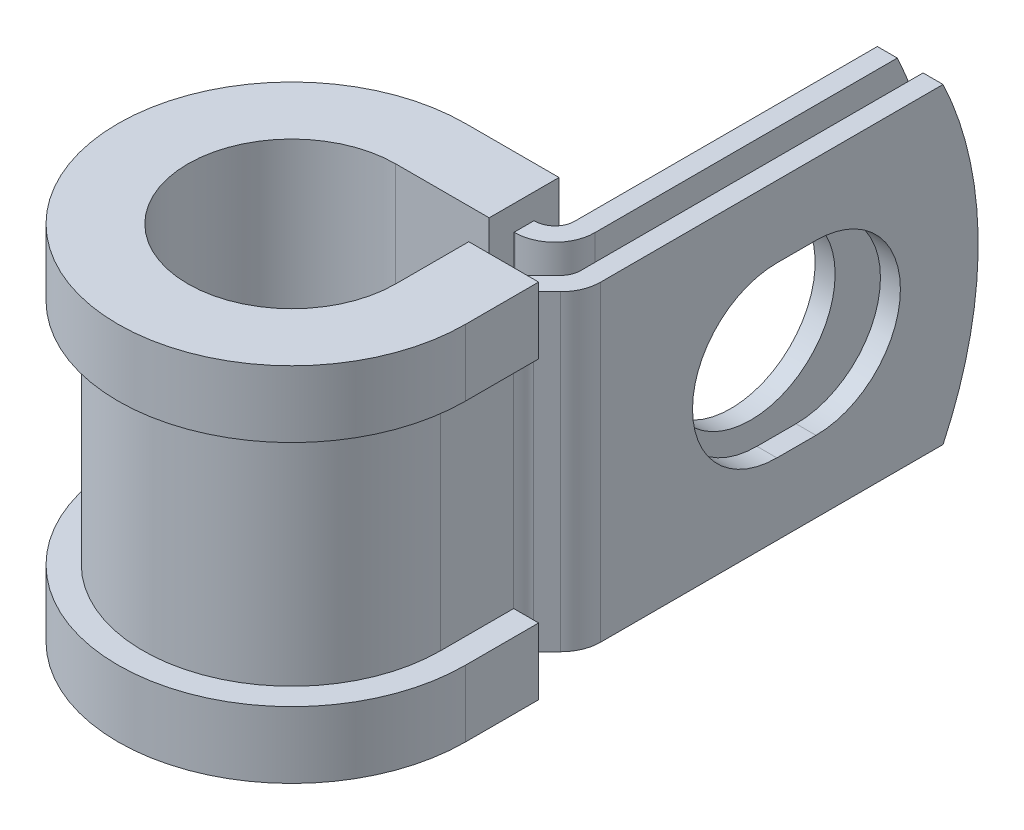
ISO-10303-21;
HEADER;
FILE_DESCRIPTION(('STEP AP214'),'2;1');
FILE_NAME('part.step','',(''),(''),'','','');
FILE_SCHEMA(('AUTOMOTIVE_DESIGN { 1 0 10303 214 1 1 1 1 }'));
ENDSEC;
DATA;
#1=APPLICATION_CONTEXT('core data for automotive mechanical design processes');
#2=APPLICATION_PROTOCOL_DEFINITION('international standard','automotive_design',2000,#1);
#3=PRODUCT_CONTEXT('',#1,'mechanical');
#4=PRODUCT('Part','Part','',(#3));
#5=PRODUCT_RELATED_PRODUCT_CATEGORY('part','',(#4));
#6=PRODUCT_DEFINITION_FORMATION('','',#4);
#7=PRODUCT_DEFINITION_CONTEXT('part definition',#1,'design');
#8=PRODUCT_DEFINITION('design','',#6,#7);
#9=PRODUCT_DEFINITION_SHAPE('','',#8);
#10=(LENGTH_UNIT() NAMED_UNIT(*) SI_UNIT(.MILLI.,.METRE.));
#11=(NAMED_UNIT(*) PLANE_ANGLE_UNIT() SI_UNIT($,.RADIAN.));
#12=(NAMED_UNIT(*) SI_UNIT($,.STERADIAN.) SOLID_ANGLE_UNIT());
#13=UNCERTAINTY_MEASURE_WITH_UNIT(LENGTH_MEASURE(1.E-05),#10,'distance_accuracy_value','');
#14=(GEOMETRIC_REPRESENTATION_CONTEXT(3) GLOBAL_UNCERTAINTY_ASSIGNED_CONTEXT((#13)) GLOBAL_UNIT_ASSIGNED_CONTEXT((#10,
#11,#12)) REPRESENTATION_CONTEXT('',''));
#15=CARTESIAN_POINT('',(0.,0.,0.));
#16=DIRECTION('',(0.,0.,1.));
#17=DIRECTION('',(1.,0.,0.));
#18=AXIS2_PLACEMENT_3D('',#15,#16,#17);
#19=CARTESIAN_POINT('',(8.55226980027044,-9.525,-7.874));
#20=DIRECTION('',(0.,1.,0.));
#21=DIRECTION('',(1.,0.,0.));
#22=AXIS2_PLACEMENT_3D('',#19,#20,#21);
#23=PLANE('',#22);
#24=DIRECTION('',(0.,0.,-1.));
#25=VECTOR('',#24,1.);
#26=CARTESIAN_POINT('',(5.70746980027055,-9.525,-7.874));
#27=LINE('',#26,#25);
#28=CARTESIAN_POINT('',(5.70746980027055,-9.525,-7.874));
#29=VERTEX_POINT('',#28);
#30=CARTESIAN_POINT('',(5.70746980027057,-9.525,-9.0932));
#31=VERTEX_POINT('',#30);
#32=EDGE_CURVE('E523',#29,#31,#27,.T.);
#33=ORIENTED_EDGE('',*,*,#32,.T.);
#34=DIRECTION('',(1.,0.,0.));
#35=VECTOR('',#34,1.);
#36=CARTESIAN_POINT('',(0.,-9.525,-9.0932));
#37=LINE('',#36,#35);
#38=CARTESIAN_POINT('',(5.75826980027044,-9.525,-9.0932));
#39=VERTEX_POINT('',#38);
#40=EDGE_CURVE('E410',#39,#31,#37,.F.);
#41=ORIENTED_EDGE('',*,*,#40,.F.);
#42=CARTESIAN_POINT('',(5.75826980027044,-9.525,-10.3124));
#43=DIRECTION('',(0.,1.,0.));
#44=DIRECTION('',(1.,0.,0.));
#45=AXIS2_PLACEMENT_3D('',#42,#43,#44);
#46=CIRCLE('',#45,1.2192);
#47=CARTESIAN_POINT('',(6.97746980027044,-9.525,-10.3124));
#48=VERTEX_POINT('',#47);
#49=EDGE_CURVE('E408',#48,#39,#46,.F.);
#50=ORIENTED_EDGE('',*,*,#49,.F.);
#51=DIRECTION('',(0.,0.,-1.));
#52=VECTOR('',#51,1.);
#53=CARTESIAN_POINT('',(6.97746980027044,-9.525,-30.9372));
#54=LINE('',#53,#52);
#55=CARTESIAN_POINT('',(6.97746980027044,-9.525,-28.7926631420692));
#56=VERTEX_POINT('',#55);
#57=EDGE_CURVE('E406',#56,#48,#54,.F.);
#58=ORIENTED_EDGE('',*,*,#57,.F.);
#59=DIRECTION('',(-1.,0.,0.));
#60=VECTOR('',#59,1.);
#61=CARTESIAN_POINT('',(10.9906698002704,-9.525,-28.7926631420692));
#62=LINE('',#61,#60);
#63=CARTESIAN_POINT('',(8.19666980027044,-9.525,-28.7926631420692));
#64=VERTEX_POINT('',#63);
#65=EDGE_CURVE('E12',#64,#56,#62,.T.);
#66=ORIENTED_EDGE('',*,*,#65,.F.);
#67=DIRECTION('',(0.,0.,1.));
#68=VECTOR('',#67,1.);
#69=CARTESIAN_POINT('',(8.19666980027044,-9.525,-30.9372));
#70=LINE('',#69,#68);
#71=CARTESIAN_POINT('',(8.19666980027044,-9.525,-10.3124));
#72=VERTEX_POINT('',#71);
#73=EDGE_CURVE('E404',#64,#72,#70,.T.);
#74=ORIENTED_EDGE('',*,*,#73,.T.);
#75=CARTESIAN_POINT('',(5.75826980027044,-9.525,-10.3124));
#76=DIRECTION('',(0.,-1.,0.));
#77=DIRECTION('',(0.,0.,1.));
#78=AXIS2_PLACEMENT_3D('',#75,#76,#77);
#79=CIRCLE('',#78,2.4384);
#80=CARTESIAN_POINT('',(5.75826980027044,-9.525,-7.874));
#81=VERTEX_POINT('',#80);
#82=EDGE_CURVE('E401',#72,#81,#79,.T.);
#83=ORIENTED_EDGE('',*,*,#82,.T.);
#84=DIRECTION('',(-1.,0.,0.));
#85=VECTOR('',#84,1.);
#86=CARTESIAN_POINT('',(0.,-9.525,-7.874));
#87=LINE('',#86,#85);
#88=EDGE_CURVE('E398',#81,#29,#87,.T.);
#89=ORIENTED_EDGE('',*,*,#88,.T.);
#90=EDGE_LOOP('',(#33,#41,#50,#58,#66,#74,#83,#89));
#91=FACE_BOUND('',#90,.T.);
#92=ADVANCED_FACE('F54',(#91),#23,.F.);
#93=CARTESIAN_POINT('',(8.55226980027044,9.525,-7.874));
#94=DIRECTION('',(0.,1.,0.));
#95=DIRECTION('',(1.,0.,0.));
#96=AXIS2_PLACEMENT_3D('',#93,#94,#95);
#97=PLANE('',#96);
#98=DIRECTION('',(1.,0.,0.));
#99=VECTOR('',#98,1.);
#100=CARTESIAN_POINT('',(0.,9.525,-9.0932));
#101=LINE('',#100,#99);
#102=CARTESIAN_POINT('',(5.75826980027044,9.525,-9.0932));
#103=VERTEX_POINT('',#102);
#104=CARTESIAN_POINT('',(5.70746980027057,9.525,-9.0932));
#105=VERTEX_POINT('',#104);
#106=EDGE_CURVE('E368',#103,#105,#101,.F.);
#107=ORIENTED_EDGE('',*,*,#106,.T.);
#108=DIRECTION('',(0.,0.,1.));
#109=VECTOR('',#108,1.);
#110=CARTESIAN_POINT('',(5.70746980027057,9.525,-9.0932));
#111=LINE('',#110,#109);
#112=CARTESIAN_POINT('',(5.70746980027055,9.525,-7.874));
#113=VERTEX_POINT('',#112);
#114=EDGE_CURVE('E517',#105,#113,#111,.T.);
#115=ORIENTED_EDGE('',*,*,#114,.T.);
#116=DIRECTION('',(-1.,0.,0.));
#117=VECTOR('',#116,1.);
#118=CARTESIAN_POINT('',(0.,9.525,-7.874));
#119=LINE('',#118,#117);
#120=CARTESIAN_POINT('',(5.75826980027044,9.525,-7.874));
#121=VERTEX_POINT('',#120);
#122=EDGE_CURVE('E625',#121,#113,#119,.T.);
#123=ORIENTED_EDGE('',*,*,#122,.F.);
#124=CARTESIAN_POINT('',(5.75826980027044,9.525,-10.3124));
#125=DIRECTION('',(0.,-1.,0.));
#126=DIRECTION('',(0.,0.,1.));
#127=AXIS2_PLACEMENT_3D('',#124,#125,#126);
#128=CIRCLE('',#127,2.4384);
#129=CARTESIAN_POINT('',(8.19666980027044,9.525,-10.3124));
#130=VERTEX_POINT('',#129);
#131=EDGE_CURVE('E370',#130,#121,#128,.T.);
#132=ORIENTED_EDGE('',*,*,#131,.F.);
#133=DIRECTION('',(0.,0.,1.));
#134=VECTOR('',#133,1.);
#135=CARTESIAN_POINT('',(8.19666980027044,9.525,-30.9372));
#136=LINE('',#135,#134);
#137=CARTESIAN_POINT('',(8.19666980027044,9.525,-28.7926631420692));
#138=VERTEX_POINT('',#137);
#139=EDGE_CURVE('E361',#138,#130,#136,.T.);
#140=ORIENTED_EDGE('',*,*,#139,.F.);
#141=DIRECTION('',(-1.,0.,0.));
#142=VECTOR('',#141,1.);
#143=CARTESIAN_POINT('',(10.9906698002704,9.525,-28.7926631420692));
#144=LINE('',#143,#142);
#145=CARTESIAN_POINT('',(6.97746980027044,9.525,-28.7926631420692));
#146=VERTEX_POINT('',#145);
#147=EDGE_CURVE('E62',#138,#146,#144,.T.);
#148=ORIENTED_EDGE('',*,*,#147,.T.);
#149=DIRECTION('',(0.,0.,-1.));
#150=VECTOR('',#149,1.);
#151=CARTESIAN_POINT('',(6.97746980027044,9.525,-30.9372));
#152=LINE('',#151,#150);
#153=CARTESIAN_POINT('',(6.97746980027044,9.525,-10.3124));
#154=VERTEX_POINT('',#153);
#155=EDGE_CURVE('E358',#146,#154,#152,.F.);
#156=ORIENTED_EDGE('',*,*,#155,.T.);
#157=CARTESIAN_POINT('',(5.75826980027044,9.525,-10.3124));
#158=DIRECTION('',(0.,1.,0.));
#159=DIRECTION('',(1.,0.,0.));
#160=AXIS2_PLACEMENT_3D('',#157,#158,#159);
#161=CIRCLE('',#160,1.2192);
#162=EDGE_CURVE('E366',#154,#103,#161,.F.);
#163=ORIENTED_EDGE('',*,*,#162,.T.);
#164=EDGE_LOOP('',(#107,#115,#123,#132,#140,#148,#156,#163));
#165=FACE_BOUND('',#164,.T.);
#166=ADVANCED_FACE('F357',(#165),#97,.T.);
#167=CARTESIAN_POINT('',(0.,9.525,-7.874));
#168=DIRECTION('',(0.,0.,1.));
#169=DIRECTION('',(1.,0.,0.));
#170=AXIS2_PLACEMENT_3D('',#167,#168,#169);
#171=PLANE('',#170);
#172=ORIENTED_EDGE('',*,*,#122,.T.);
#173=DIRECTION('',(0.,-1.,0.));
#174=VECTOR('',#173,1.);
#175=CARTESIAN_POINT('',(5.70746980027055,9.525,-7.874));
#176=LINE('',#175,#174);
#177=EDGE_CURVE('E520',#113,#29,#176,.T.);
#178=ORIENTED_EDGE('',*,*,#177,.T.);
#179=ORIENTED_EDGE('',*,*,#88,.F.);
#180=DIRECTION('',(0.,-1.,0.));
#181=VECTOR('',#180,1.);
#182=CARTESIAN_POINT('',(5.75826980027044,9.525,-7.874));
#183=LINE('',#182,#181);
#184=EDGE_CURVE('E344',#121,#81,#183,.T.);
#185=ORIENTED_EDGE('',*,*,#184,.F.);
#186=EDGE_LOOP('',(#172,#178,#179,#185));
#187=FACE_BOUND('',#186,.T.);
#188=ADVANCED_FACE('F635',(#187),#171,.T.);
#189=CARTESIAN_POINT('',(10.9906698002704,9.525,-7.874));
#190=DIRECTION('',(-1.,0.,0.));
#191=DIRECTION('',(0.,0.,1.));
#192=AXIS2_PLACEMENT_3D('',#189,#190,#191);
#193=PLANE('',#192);
#194=CARTESIAN_POINT('',(10.9906698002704,0.,-21.0311999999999));
#195=DIRECTION('',(1.,0.,0.));
#196=DIRECTION('',(0.,0.,-1.));
#197=AXIS2_PLACEMENT_3D('',#194,#195,#196);
#198=CIRCLE('',#197,5.1562);
#199=CARTESIAN_POINT('',(10.9906698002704,-5.1562,-21.0312000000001));
#200=VERTEX_POINT('',#199);
#201=CARTESIAN_POINT('',(10.9906698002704,5.1562,-21.0312000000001));
#202=VERTEX_POINT('',#201);
#203=EDGE_CURVE('E580',#200,#202,#198,.T.);
#204=ORIENTED_EDGE('',*,*,#203,.F.);
#205=DIRECTION('',(0.,0.,-1.));
#206=VECTOR('',#205,1.);
#207=CARTESIAN_POINT('',(10.9906698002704,-5.1562,-18.6435999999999));
#208=LINE('',#207,#206);
#209=CARTESIAN_POINT('',(10.9906698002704,-5.1562,-18.6435999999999));
#210=VERTEX_POINT('',#209);
#211=EDGE_CURVE('E583',#210,#200,#208,.T.);
#212=ORIENTED_EDGE('',*,*,#211,.F.);
#213=CARTESIAN_POINT('',(10.9906698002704,0.,-18.6435999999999));
#214=DIRECTION('',(1.,0.,0.));
#215=DIRECTION('',(0.,0.,-1.));
#216=AXIS2_PLACEMENT_3D('',#213,#214,#215);
#217=CIRCLE('',#216,5.1562);
#218=CARTESIAN_POINT('',(10.9906698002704,5.1562,-18.6435999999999));
#219=VERTEX_POINT('',#218);
#220=EDGE_CURVE('E576',#219,#210,#217,.T.);
#221=ORIENTED_EDGE('',*,*,#220,.F.);
#222=DIRECTION('',(0.,0.,1.));
#223=VECTOR('',#222,1.);
#224=CARTESIAN_POINT('',(10.9906698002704,5.1562,-18.6435999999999));
#225=LINE('',#224,#223);
#226=EDGE_CURVE('E577',#202,#219,#225,.T.);
#227=ORIENTED_EDGE('',*,*,#226,.F.);
#228=EDGE_LOOP('',(#204,#212,#221,#227));
#229=FACE_BOUND('',#228,.T.);
#230=DIRECTION('',(0.,0.,-1.));
#231=VECTOR('',#230,1.);
#232=CARTESIAN_POINT('',(10.9906698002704,-9.525,-7.874));
#233=LINE('',#232,#231);
#234=CARTESIAN_POINT('',(10.9906698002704,-9.525,-7.874));
#235=VERTEX_POINT('',#234);
#236=CARTESIAN_POINT('',(10.9906698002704,-9.525,-28.7926631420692));
#237=VERTEX_POINT('',#236);
#238=EDGE_CURVE('E382',#235,#237,#233,.T.);
#239=ORIENTED_EDGE('',*,*,#238,.T.);
#240=CARTESIAN_POINT('',(10.9906698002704,0.,-8.7122));
#241=DIRECTION('',(-1.,0.,0.));
#242=DIRECTION('',(0.,0.,1.));
#243=AXIS2_PLACEMENT_3D('',#240,#241,#242);
#244=CIRCLE('',#243,22.225);
#245=CARTESIAN_POINT('',(10.9906698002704,9.525,-28.7926631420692));
#246=VERTEX_POINT('',#245);
#247=EDGE_CURVE('E568',#246,#237,#244,.T.);
#248=ORIENTED_EDGE('',*,*,#247,.F.);
#249=DIRECTION('',(0.,0.,-1.));
#250=VECTOR('',#249,1.);
#251=CARTESIAN_POINT('',(10.9906698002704,9.525,-7.874));
#252=LINE('',#251,#250);
#253=CARTESIAN_POINT('',(10.9906698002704,9.525,-7.874));
#254=VERTEX_POINT('',#253);
#255=EDGE_CURVE('E419',#254,#246,#252,.T.);
#256=ORIENTED_EDGE('',*,*,#255,.F.);
#257=DIRECTION('',(0.,-1.,0.));
#258=VECTOR('',#257,1.);
#259=CARTESIAN_POINT('',(10.9906698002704,9.525,-7.874));
#260=LINE('',#259,#258);
#261=EDGE_CURVE('E381',#254,#235,#260,.T.);
#262=ORIENTED_EDGE('',*,*,#261,.T.);
#263=EDGE_LOOP('',(#239,#248,#256,#262));
#264=FACE_BOUND('',#263,.T.);
#265=ADVANCED_FACE('F56',(#229,#264),#193,.F.);
#266=CARTESIAN_POINT('',(9.77146980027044,9.525,-7.874));
#267=DIRECTION('',(-1.,0.,0.));
#268=DIRECTION('',(0.,0.,1.));
#269=AXIS2_PLACEMENT_3D('',#266,#267,#268);
#270=PLANE('',#269);
#271=DIRECTION('',(0.,0.,-1.));
#272=VECTOR('',#271,1.);
#273=CARTESIAN_POINT('',(9.77146980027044,-5.1562,-18.6435999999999));
#274=LINE('',#273,#272);
#275=CARTESIAN_POINT('',(9.77146980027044,-5.1562,-18.6435999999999));
#276=VERTEX_POINT('',#275);
#277=CARTESIAN_POINT('',(9.77146980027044,-5.1562,-21.0312000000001));
#278=VERTEX_POINT('',#277);
#279=EDGE_CURVE('E579',#276,#278,#274,.T.);
#280=ORIENTED_EDGE('',*,*,#279,.T.);
#281=CARTESIAN_POINT('',(9.77146980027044,0.,-21.0311999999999));
#282=DIRECTION('',(-1.,0.,0.));
#283=DIRECTION('',(0.,0.,1.));
#284=AXIS2_PLACEMENT_3D('',#281,#282,#283);
#285=CIRCLE('',#284,5.1562);
#286=CARTESIAN_POINT('',(9.77146980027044,5.1562,-21.0312000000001));
#287=VERTEX_POINT('',#286);
#288=EDGE_CURVE('E600',#278,#287,#285,.F.);
#289=ORIENTED_EDGE('',*,*,#288,.T.);
#290=DIRECTION('',(0.,0.,1.));
#291=VECTOR('',#290,1.);
#292=CARTESIAN_POINT('',(9.77146980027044,5.1562,-18.6435999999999));
#293=LINE('',#292,#291);
#294=CARTESIAN_POINT('',(9.77146980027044,5.1562,-18.6435999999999));
#295=VERTEX_POINT('',#294);
#296=EDGE_CURVE('E596',#287,#295,#293,.T.);
#297=ORIENTED_EDGE('',*,*,#296,.T.);
#298=CARTESIAN_POINT('',(9.77146980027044,0.,-18.6435999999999));
#299=DIRECTION('',(-1.,0.,0.));
#300=DIRECTION('',(0.,0.,1.));
#301=AXIS2_PLACEMENT_3D('',#298,#299,#300);
#302=CIRCLE('',#301,5.1562);
#303=EDGE_CURVE('E591',#295,#276,#302,.F.);
#304=ORIENTED_EDGE('',*,*,#303,.T.);
#305=EDGE_LOOP('',(#280,#289,#297,#304));
#306=FACE_BOUND('',#305,.T.);
#307=CARTESIAN_POINT('',(9.77146980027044,0.,-8.7122));
#308=DIRECTION('',(-1.,0.,0.));
#309=DIRECTION('',(0.,0.,1.));
#310=AXIS2_PLACEMENT_3D('',#307,#308,#309);
#311=CIRCLE('',#310,22.225);
#312=CARTESIAN_POINT('',(9.77146980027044,9.525,-28.7926631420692));
#313=VERTEX_POINT('',#312);
#314=CARTESIAN_POINT('',(9.77146980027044,-9.525,-28.7926631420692));
#315=VERTEX_POINT('',#314);
#316=EDGE_CURVE('E76',#313,#315,#311,.T.);
#317=ORIENTED_EDGE('',*,*,#316,.T.);
#318=DIRECTION('',(0.,0.,-1.));
#319=VECTOR('',#318,1.);
#320=CARTESIAN_POINT('',(9.77146980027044,-9.525,-7.874));
#321=LINE('',#320,#319);
#322=CARTESIAN_POINT('',(9.77146980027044,-9.525,-7.874));
#323=VERTEX_POINT('',#322);
#324=EDGE_CURVE('E385',#323,#315,#321,.T.);
#325=ORIENTED_EDGE('',*,*,#324,.F.);
#326=DIRECTION('',(0.,-1.,0.));
#327=VECTOR('',#326,1.);
#328=CARTESIAN_POINT('',(9.77146980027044,9.525,-7.874));
#329=LINE('',#328,#327);
#330=CARTESIAN_POINT('',(9.77146980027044,9.525,-7.874));
#331=VERTEX_POINT('',#330);
#332=EDGE_CURVE('E352',#331,#323,#329,.T.);
#333=ORIENTED_EDGE('',*,*,#332,.F.);
#334=DIRECTION('',(0.,0.,-1.));
#335=VECTOR('',#334,1.);
#336=CARTESIAN_POINT('',(9.77146980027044,9.525,-7.874));
#337=LINE('',#336,#335);
#338=EDGE_CURVE('E615',#331,#313,#337,.T.);
#339=ORIENTED_EDGE('',*,*,#338,.T.);
#340=EDGE_LOOP('',(#317,#325,#333,#339));
#341=FACE_BOUND('',#340,.T.);
#342=ADVANCED_FACE('F689',(#306,#341),#270,.T.);
#343=CARTESIAN_POINT('',(8.19666980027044,9.525,-30.9372));
#344=DIRECTION('',(1.,0.,0.));
#345=DIRECTION('',(0.,0.,-1.));
#346=AXIS2_PLACEMENT_3D('',#343,#344,#345);
#347=PLANE('',#346);
#348=CARTESIAN_POINT('',(8.19666980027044,0.,-19.8374));
#349=DIRECTION('',(1.,0.,0.));
#350=DIRECTION('',(0.,0.,-1.));
#351=AXIS2_PLACEMENT_3D('',#348,#349,#350);
#352=CIRCLE('',#351,5.1562);
#353=CARTESIAN_POINT('',(8.19666980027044,0.,-24.9936));
#354=VERTEX_POINT('',#353);
#355=EDGE_CURVE('E386',#354,#354,#352,.F.);
#356=ORIENTED_EDGE('',*,*,#355,.T.);
#357=EDGE_LOOP('',(#356));
#358=FACE_BOUND('',#357,.T.);
#359=ORIENTED_EDGE('',*,*,#73,.F.);
#360=CARTESIAN_POINT('',(8.19666980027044,0.,-8.7122));
#361=DIRECTION('',(1.,0.,0.));
#362=DIRECTION('',(0.,0.,-1.));
#363=AXIS2_PLACEMENT_3D('',#360,#361,#362);
#364=CIRCLE('',#363,22.225);
#365=EDGE_CURVE('E573',#64,#138,#364,.T.);
#366=ORIENTED_EDGE('',*,*,#365,.T.);
#367=ORIENTED_EDGE('',*,*,#139,.T.);
#368=DIRECTION('',(0.,-1.,0.));
#369=VECTOR('',#368,1.);
#370=CARTESIAN_POINT('',(8.19666980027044,9.525,-10.3124));
#371=LINE('',#370,#369);
#372=EDGE_CURVE('E341',#130,#72,#371,.T.);
#373=ORIENTED_EDGE('',*,*,#372,.T.);
#374=EDGE_LOOP('',(#359,#366,#367,#373));
#375=FACE_BOUND('',#374,.T.);
#376=ADVANCED_FACE('F641',(#358,#375),#347,.T.);
#377=CARTESIAN_POINT('',(6.97746980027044,9.525,-30.9372));
#378=DIRECTION('',(1.,0.,0.));
#379=DIRECTION('',(0.,0.,-1.));
#380=AXIS2_PLACEMENT_3D('',#377,#378,#379);
#381=PLANE('',#380);
#382=CARTESIAN_POINT('',(6.97746980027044,0.,-19.8374));
#383=DIRECTION('',(-1.,0.,0.));
#384=DIRECTION('',(0.,0.,1.));
#385=AXIS2_PLACEMENT_3D('',#382,#383,#384);
#386=CIRCLE('',#385,5.1562);
#387=CARTESIAN_POINT('',(6.97746980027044,0.,-14.6812));
#388=VERTEX_POINT('',#387);
#389=EDGE_CURVE('E608',#388,#388,#386,.T.);
#390=ORIENTED_EDGE('',*,*,#389,.F.);
#391=EDGE_LOOP('',(#390));
#392=FACE_BOUND('',#391,.T.);
#393=CARTESIAN_POINT('',(6.97746980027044,0.,-8.7122));
#394=DIRECTION('',(-1.,0.,0.));
#395=DIRECTION('',(0.,0.,1.));
#396=AXIS2_PLACEMENT_3D('',#393,#394,#395);
#397=CIRCLE('',#396,22.225);
#398=EDGE_CURVE('E68',#146,#56,#397,.T.);
#399=ORIENTED_EDGE('',*,*,#398,.T.);
#400=ORIENTED_EDGE('',*,*,#57,.T.);
#401=DIRECTION('',(0.,-1.,0.));
#402=VECTOR('',#401,1.);
#403=CARTESIAN_POINT('',(6.97746980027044,9.525,-10.3124));
#404=LINE('',#403,#402);
#405=EDGE_CURVE('E338',#154,#48,#404,.T.);
#406=ORIENTED_EDGE('',*,*,#405,.F.);
#407=ORIENTED_EDGE('',*,*,#155,.F.);
#408=EDGE_LOOP('',(#399,#400,#406,#407));
#409=FACE_BOUND('',#408,.T.);
#410=ADVANCED_FACE('F364',(#392,#409),#381,.F.);
#411=CARTESIAN_POINT('',(10.3124,-9.525,-4.46150267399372));
#412=DIRECTION('',(0.,1.,0.));
#413=DIRECTION('',(1.,0.,0.));
#414=AXIS2_PLACEMENT_3D('',#411,#412,#413);
#415=CIRCLE('',#414,1.2192);
#416=CARTESIAN_POINT('',(9.0932,-9.525,-4.46150267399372));
#417=VERTEX_POINT('',#416);
#418=CARTESIAN_POINT('',(9.45029541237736,-9.525,-5.32360726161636));
#419=VERTEX_POINT('',#418);
#420=EDGE_CURVE('E413',#417,#419,#415,.F.);
#421=ORIENTED_EDGE('',*,*,#420,.F.);
#422=DIRECTION('',(1.,0.,0.));
#423=VECTOR('',#422,1.);
#424=CARTESIAN_POINT('',(7.874,-9.525,-4.46150267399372));
#425=LINE('',#424,#423);
#426=CARTESIAN_POINT('',(7.874,-9.525,-4.46150267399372));
#427=VERTEX_POINT('',#426);
#428=EDGE_CURVE('E451',#427,#417,#425,.T.);
#429=ORIENTED_EDGE('',*,*,#428,.F.);
#430=CARTESIAN_POINT('',(10.3124,-9.525,-4.46150267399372));
#431=DIRECTION('',(0.,-1.,0.));
#432=DIRECTION('',(0.,0.,1.));
#433=AXIS2_PLACEMENT_3D('',#430,#431,#432);
#434=CIRCLE('',#433,2.4384);
#435=CARTESIAN_POINT('',(8.58819082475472,-9.525,-6.185711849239));
#436=VERTEX_POINT('',#435);
#437=EDGE_CURVE('E395',#427,#436,#434,.T.);
#438=ORIENTED_EDGE('',*,*,#437,.T.);
#439=DIRECTION('',(0.707106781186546,0.,-0.707106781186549));
#440=VECTOR('',#439,1.);
#441=CARTESIAN_POINT('',(8.58819082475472,-9.525,-6.185711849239));
#442=LINE('',#441,#440);
#443=CARTESIAN_POINT('',(9.41437438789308,-9.525,-7.01189541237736));
#444=VERTEX_POINT('',#443);
#445=EDGE_CURVE('E392',#436,#444,#442,.T.);
#446=ORIENTED_EDGE('',*,*,#445,.T.);
#447=CARTESIAN_POINT('',(8.55226980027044,-9.525,-7.874));
#448=DIRECTION('',(0.,1.,0.));
#449=DIRECTION('',(0.,0.,1.));
#450=AXIS2_PLACEMENT_3D('',#447,#448,#449);
#451=CIRCLE('',#450,1.2192);
#452=EDGE_CURVE('E389',#444,#323,#451,.T.);
#453=ORIENTED_EDGE('',*,*,#452,.T.);
#454=ORIENTED_EDGE('',*,*,#324,.T.);
#455=DIRECTION('',(-1.,0.,0.));
#456=VECTOR('',#455,1.);
#457=CARTESIAN_POINT('',(10.9906698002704,-9.525,-28.7926631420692));
#458=LINE('',#457,#456);
#459=EDGE_CURVE('E566',#237,#315,#458,.T.);
#460=ORIENTED_EDGE('',*,*,#459,.F.);
#461=ORIENTED_EDGE('',*,*,#238,.F.);
#462=CARTESIAN_POINT('',(8.55226980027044,-9.525,-7.874));
#463=DIRECTION('',(0.,1.,0.));
#464=DIRECTION('',(1.,0.,0.));
#465=AXIS2_PLACEMENT_3D('',#462,#463,#464);
#466=CIRCLE('',#465,2.4384);
#467=CARTESIAN_POINT('',(10.2764789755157,-9.525,-6.14979082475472));
#468=VERTEX_POINT('',#467);
#469=EDGE_CURVE('E417',#468,#235,#466,.T.);
#470=ORIENTED_EDGE('',*,*,#469,.F.);
#471=DIRECTION('',(0.707106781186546,0.,-0.707106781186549));
#472=VECTOR('',#471,1.);
#473=CARTESIAN_POINT('',(9.45029541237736,-9.525,-5.32360726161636));
#474=LINE('',#473,#472);
#475=EDGE_CURVE('E415',#419,#468,#474,.T.);
#476=ORIENTED_EDGE('',*,*,#475,.F.);
#477=EDGE_LOOP('',(#421,#429,#438,#446,#453,#454,#460,#461,#470,#476));
#478=FACE_BOUND('',#477,.T.);
#479=ADVANCED_FACE('F675',(#478),#23,.F.);
#480=DIRECTION('',(-1.,0.,0.));
#481=VECTOR('',#480,1.);
#482=CARTESIAN_POINT('',(9.0932,9.525,-4.46150267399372));
#483=LINE('',#482,#481);
#484=CARTESIAN_POINT('',(9.0932,9.525,-4.46150267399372));
#485=VERTEX_POINT('',#484);
#486=CARTESIAN_POINT('',(7.874,9.525,-4.46150267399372));
#487=VERTEX_POINT('',#486);
#488=EDGE_CURVE('E440',#485,#487,#483,.T.);
#489=ORIENTED_EDGE('',*,*,#488,.F.);
#490=CARTESIAN_POINT('',(10.3124,9.525,-4.46150267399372));
#491=DIRECTION('',(0.,1.,0.));
#492=DIRECTION('',(1.,0.,0.));
#493=AXIS2_PLACEMENT_3D('',#490,#491,#492);
#494=CIRCLE('',#493,1.2192);
#495=CARTESIAN_POINT('',(9.45029541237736,9.525,-5.32360726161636));
#496=VERTEX_POINT('',#495);
#497=EDGE_CURVE('E375',#485,#496,#494,.F.);
#498=ORIENTED_EDGE('',*,*,#497,.T.);
#499=DIRECTION('',(0.707106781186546,0.,-0.707106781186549));
#500=VECTOR('',#499,1.);
#501=CARTESIAN_POINT('',(9.45029541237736,9.525,-5.32360726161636));
#502=LINE('',#501,#500);
#503=CARTESIAN_POINT('',(10.2764789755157,9.525,-6.14979082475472));
#504=VERTEX_POINT('',#503);
#505=EDGE_CURVE('E377',#496,#504,#502,.T.);
#506=ORIENTED_EDGE('',*,*,#505,.T.);
#507=CARTESIAN_POINT('',(8.55226980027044,9.525,-7.874));
#508=DIRECTION('',(0.,1.,0.));
#509=DIRECTION('',(1.,0.,0.));
#510=AXIS2_PLACEMENT_3D('',#507,#508,#509);
#511=CIRCLE('',#510,2.4384);
#512=EDGE_CURVE('E379',#504,#254,#511,.T.);
#513=ORIENTED_EDGE('',*,*,#512,.T.);
#514=ORIENTED_EDGE('',*,*,#255,.T.);
#515=DIRECTION('',(-1.,0.,0.));
#516=VECTOR('',#515,1.);
#517=CARTESIAN_POINT('',(10.9906698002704,9.525,-28.7926631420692));
#518=LINE('',#517,#516);
#519=EDGE_CURVE('E570',#246,#313,#518,.T.);
#520=ORIENTED_EDGE('',*,*,#519,.T.);
#521=ORIENTED_EDGE('',*,*,#338,.F.);
#522=CARTESIAN_POINT('',(8.55226980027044,9.525,-7.874));
#523=DIRECTION('',(0.,1.,0.));
#524=DIRECTION('',(0.,0.,1.));
#525=AXIS2_PLACEMENT_3D('',#522,#523,#524);
#526=CIRCLE('',#525,1.2192);
#527=CARTESIAN_POINT('',(9.41437438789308,9.525,-7.01189541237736));
#528=VERTEX_POINT('',#527);
#529=EDGE_CURVE('E618',#528,#331,#526,.T.);
#530=ORIENTED_EDGE('',*,*,#529,.F.);
#531=DIRECTION('',(0.707106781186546,0.,-0.707106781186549));
#532=VECTOR('',#531,1.);
#533=CARTESIAN_POINT('',(8.58819082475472,9.525,-6.185711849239));
#534=LINE('',#533,#532);
#535=CARTESIAN_POINT('',(8.58819082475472,9.525,-6.185711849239));
#536=VERTEX_POINT('',#535);
#537=EDGE_CURVE('E621',#536,#528,#534,.T.);
#538=ORIENTED_EDGE('',*,*,#537,.F.);
#539=CARTESIAN_POINT('',(10.3124,9.525,-4.46150267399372));
#540=DIRECTION('',(0.,-1.,0.));
#541=DIRECTION('',(0.,0.,1.));
#542=AXIS2_PLACEMENT_3D('',#539,#540,#541);
#543=CIRCLE('',#542,2.4384);
#544=EDGE_CURVE('E450',#487,#536,#543,.T.);
#545=ORIENTED_EDGE('',*,*,#544,.F.);
#546=EDGE_LOOP('',(#489,#498,#506,#513,#514,#520,#521,#530,#538,#545));
#547=FACE_BOUND('',#546,.T.);
#548=ADVANCED_FACE('F447',(#547),#97,.T.);
#549=CARTESIAN_POINT('',(8.55226980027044,9.525,-7.874));
#550=DIRECTION('',(0.,-1.,0.));
#551=DIRECTION('',(0.,0.,-1.));
#552=AXIS2_PLACEMENT_3D('',#549,#550,#551);
#553=CYLINDRICAL_SURFACE('',#552,1.2192);
#554=ORIENTED_EDGE('',*,*,#452,.F.);
#555=DIRECTION('',(0.,-1.,0.));
#556=VECTOR('',#555,1.);
#557=CARTESIAN_POINT('',(9.41437438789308,9.525,-7.01189541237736));
#558=LINE('',#557,#556);
#559=EDGE_CURVE('E350',#528,#444,#558,.T.);
#560=ORIENTED_EDGE('',*,*,#559,.F.);
#561=ORIENTED_EDGE('',*,*,#529,.T.);
#562=ORIENTED_EDGE('',*,*,#332,.T.);
#563=EDGE_LOOP('',(#554,#560,#561,#562));
#564=FACE_BOUND('',#563,.T.);
#565=ADVANCED_FACE('F685',(#564),#553,.F.);
#566=CARTESIAN_POINT('',(8.58819082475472,9.525,-6.185711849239));
#567=DIRECTION('',(-0.707106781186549,0.,-0.707106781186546));
#568=DIRECTION('',(-0.707106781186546,0.,0.707106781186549));
#569=AXIS2_PLACEMENT_3D('',#566,#567,#568);
#570=PLANE('',#569);
#571=ORIENTED_EDGE('',*,*,#445,.F.);
#572=DIRECTION('',(0.,-1.,0.));
#573=VECTOR('',#572,1.);
#574=CARTESIAN_POINT('',(8.58819082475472,9.525,-6.185711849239));
#575=LINE('',#574,#573);
#576=EDGE_CURVE('E348',#536,#436,#575,.T.);
#577=ORIENTED_EDGE('',*,*,#576,.F.);
#578=ORIENTED_EDGE('',*,*,#537,.T.);
#579=ORIENTED_EDGE('',*,*,#559,.T.);
#580=EDGE_LOOP('',(#571,#577,#578,#579));
#581=FACE_BOUND('',#580,.T.);
#582=ADVANCED_FACE('F680',(#581),#570,.T.);
#583=CARTESIAN_POINT('',(10.3124,9.525,-4.46150267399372));
#584=DIRECTION('',(0.,-1.,0.));
#585=DIRECTION('',(0.,0.,-1.));
#586=AXIS2_PLACEMENT_3D('',#583,#584,#585);
#587=CYLINDRICAL_SURFACE('',#586,2.4384);
#588=ORIENTED_EDGE('',*,*,#437,.F.);
#589=DIRECTION('',(0.,-1.,0.));
#590=VECTOR('',#589,1.);
#591=CARTESIAN_POINT('',(7.874,9.525,-4.46150267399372));
#592=LINE('',#591,#590);
#593=EDGE_CURVE('E346',#487,#427,#592,.T.);
#594=ORIENTED_EDGE('',*,*,#593,.F.);
#595=ORIENTED_EDGE('',*,*,#544,.T.);
#596=ORIENTED_EDGE('',*,*,#576,.T.);
#597=EDGE_LOOP('',(#588,#594,#595,#596));
#598=FACE_BOUND('',#597,.T.);
#599=ADVANCED_FACE('F677',(#598),#587,.T.);
#600=CARTESIAN_POINT('',(5.75826980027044,9.525,-10.3124));
#601=DIRECTION('',(0.,-1.,0.));
#602=DIRECTION('',(0.,0.,-1.));
#603=AXIS2_PLACEMENT_3D('',#600,#601,#602);
#604=CYLINDRICAL_SURFACE('',#603,2.4384);
#605=ORIENTED_EDGE('',*,*,#82,.F.);
#606=ORIENTED_EDGE('',*,*,#372,.F.);
#607=ORIENTED_EDGE('',*,*,#131,.T.);
#608=ORIENTED_EDGE('',*,*,#184,.T.);
#609=EDGE_LOOP('',(#605,#606,#607,#608));
#610=FACE_BOUND('',#609,.T.);
#611=ADVANCED_FACE('F631',(#610),#604,.T.);
#612=CARTESIAN_POINT('',(5.75826980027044,9.525,-10.3124));
#613=DIRECTION('',(0.,-1.,0.));
#614=DIRECTION('',(0.,0.,-1.));
#615=AXIS2_PLACEMENT_3D('',#612,#613,#614);
#616=CYLINDRICAL_SURFACE('',#615,1.2192);
#617=ORIENTED_EDGE('',*,*,#49,.T.);
#618=DIRECTION('',(0.,-1.,0.));
#619=VECTOR('',#618,1.);
#620=CARTESIAN_POINT('',(5.75826980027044,9.525,-9.0932));
#621=LINE('',#620,#619);
#622=EDGE_CURVE('E329',#103,#39,#621,.T.);
#623=ORIENTED_EDGE('',*,*,#622,.F.);
#624=ORIENTED_EDGE('',*,*,#162,.F.);
#625=ORIENTED_EDGE('',*,*,#405,.T.);
#626=EDGE_LOOP('',(#617,#623,#624,#625));
#627=FACE_BOUND('',#626,.T.);
#628=ADVANCED_FACE('F646',(#627),#616,.F.);
#629=CARTESIAN_POINT('',(0.,9.525,-9.0932));
#630=DIRECTION('',(0.,0.,1.));
#631=DIRECTION('',(1.,0.,0.));
#632=AXIS2_PLACEMENT_3D('',#629,#630,#631);
#633=PLANE('',#632);
#634=DIRECTION('',(0.,-1.,0.));
#635=VECTOR('',#634,1.);
#636=CARTESIAN_POINT('',(0.,9.525,-9.0932));
#637=LINE('',#636,#635);
#638=CARTESIAN_POINT('',(1.27551750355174E-13,6.985,-9.0932));
#639=VERTEX_POINT('',#638);
#640=CARTESIAN_POINT('',(1.27551750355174E-13,-6.985,-9.0932));
#641=VERTEX_POINT('',#640);
#642=EDGE_CURVE('E320',#639,#641,#637,.T.);
#643=ORIENTED_EDGE('',*,*,#642,.F.);
#644=DIRECTION('',(1.,0.,0.));
#645=VECTOR('',#644,1.);
#646=CARTESIAN_POINT('',(1.27551750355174E-13,6.985,-9.0932));
#647=LINE('',#646,#645);
#648=CARTESIAN_POINT('',(5.70746980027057,6.985,-9.0932));
#649=VERTEX_POINT('',#648);
#650=EDGE_CURVE('E563',#639,#649,#647,.T.);
#651=ORIENTED_EDGE('',*,*,#650,.T.);
#652=DIRECTION('',(0.,1.,0.));
#653=VECTOR('',#652,1.);
#654=CARTESIAN_POINT('',(5.70746980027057,9.525,-9.0932));
#655=LINE('',#654,#653);
#656=EDGE_CURVE('E514',#649,#105,#655,.T.);
#657=ORIENTED_EDGE('',*,*,#656,.T.);
#658=ORIENTED_EDGE('',*,*,#106,.F.);
#659=ORIENTED_EDGE('',*,*,#622,.T.);
#660=ORIENTED_EDGE('',*,*,#40,.T.);
#661=DIRECTION('',(0.,1.,0.));
#662=VECTOR('',#661,1.);
#663=CARTESIAN_POINT('',(5.70746980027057,-9.525,-9.0932));
#664=LINE('',#663,#662);
#665=CARTESIAN_POINT('',(5.70746980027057,-6.985,-9.0932));
#666=VERTEX_POINT('',#665);
#667=EDGE_CURVE('E526',#31,#666,#664,.T.);
#668=ORIENTED_EDGE('',*,*,#667,.T.);
#669=DIRECTION('',(1.,0.,0.));
#670=VECTOR('',#669,1.);
#671=CARTESIAN_POINT('',(1.27551750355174E-13,-6.985,-9.0932));
#672=LINE('',#671,#670);
#673=EDGE_CURVE('E543',#641,#666,#672,.T.);
#674=ORIENTED_EDGE('',*,*,#673,.F.);
#675=EDGE_LOOP('',(#643,#651,#657,#658,#659,#660,#668,#674));
#676=FACE_BOUND('',#675,.T.);
#677=ADVANCED_FACE('F650',(#676),#633,.F.);
#678=CARTESIAN_POINT('',(0.,9.525,0.));
#679=DIRECTION('',(0.,-1.,0.));
#680=DIRECTION('',(0.,0.,-1.));
#681=AXIS2_PLACEMENT_3D('',#678,#679,#680);
#682=CYLINDRICAL_SURFACE('',#681,9.0932);
#683=DIRECTION('',(0.,-1.,0.));
#684=VECTOR('',#683,1.);
#685=CARTESIAN_POINT('',(9.0932,9.525,0.));
#686=LINE('',#685,#684);
#687=CARTESIAN_POINT('',(9.0932,6.985,0.));
#688=VERTEX_POINT('',#687);
#689=CARTESIAN_POINT('',(9.0932,-6.985,0.));
#690=VERTEX_POINT('',#689);
#691=EDGE_CURVE('E318',#688,#690,#686,.T.);
#692=ORIENTED_EDGE('',*,*,#691,.F.);
#693=CARTESIAN_POINT('',(0.,6.985,0.));
#694=DIRECTION('',(0.,-1.,0.));
#695=DIRECTION('',(0.,0.,-1.));
#696=AXIS2_PLACEMENT_3D('',#693,#694,#695);
#697=CIRCLE('',#696,9.0932);
#698=EDGE_CURVE('E512',#688,#639,#697,.T.);
#699=ORIENTED_EDGE('',*,*,#698,.T.);
#700=ORIENTED_EDGE('',*,*,#642,.T.);
#701=CARTESIAN_POINT('',(0.,-6.985,0.));
#702=DIRECTION('',(0.,-1.,0.));
#703=DIRECTION('',(0.,0.,-1.));
#704=AXIS2_PLACEMENT_3D('',#701,#702,#703);
#705=CIRCLE('',#704,9.0932);
#706=EDGE_CURVE('E301',#690,#641,#705,.T.);
#707=ORIENTED_EDGE('',*,*,#706,.F.);
#708=EDGE_LOOP('',(#692,#699,#700,#707));
#709=FACE_BOUND('',#708,.T.);
#710=ADVANCED_FACE('F316',(#709),#682,.T.);
#711=CARTESIAN_POINT('',(9.0932,9.525,0.));
#712=DIRECTION('',(-1.,0.,0.));
#713=DIRECTION('',(0.,0.,1.));
#714=AXIS2_PLACEMENT_3D('',#711,#712,#713);
#715=PLANE('',#714);
#716=DIRECTION('',(0.,-1.,0.));
#717=VECTOR('',#716,1.);
#718=CARTESIAN_POINT('',(9.0932,9.525,-4.46150267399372));
#719=LINE('',#718,#717);
#720=CARTESIAN_POINT('',(9.0932,6.985,-4.46150267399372));
#721=VERTEX_POINT('',#720);
#722=CARTESIAN_POINT('',(9.0932,-6.985,-4.46150267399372));
#723=VERTEX_POINT('',#722);
#724=EDGE_CURVE('E332',#721,#723,#719,.T.);
#725=ORIENTED_EDGE('',*,*,#724,.F.);
#726=DIRECTION('',(0.,0.,-1.));
#727=VECTOR('',#726,1.);
#728=CARTESIAN_POINT('',(9.0932,6.985,0.));
#729=LINE('',#728,#727);
#730=EDGE_CURVE('E326',#688,#721,#729,.T.);
#731=ORIENTED_EDGE('',*,*,#730,.F.);
#732=ORIENTED_EDGE('',*,*,#691,.T.);
#733=DIRECTION('',(0.,0.,-1.));
#734=VECTOR('',#733,1.);
#735=CARTESIAN_POINT('',(9.0932,-6.985,0.));
#736=LINE('',#735,#734);
#737=EDGE_CURVE('E297',#690,#723,#736,.T.);
#738=ORIENTED_EDGE('',*,*,#737,.T.);
#739=EDGE_LOOP('',(#725,#731,#732,#738));
#740=FACE_BOUND('',#739,.T.);
#741=ADVANCED_FACE('F325',(#740),#715,.F.);
#742=CARTESIAN_POINT('',(10.3124,9.525,-4.46150267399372));
#743=DIRECTION('',(0.,-1.,0.));
#744=DIRECTION('',(0.,0.,-1.));
#745=AXIS2_PLACEMENT_3D('',#742,#743,#744);
#746=CYLINDRICAL_SURFACE('',#745,1.2192);
#747=ORIENTED_EDGE('',*,*,#420,.T.);
#748=DIRECTION('',(0.,-1.,0.));
#749=VECTOR('',#748,1.);
#750=CARTESIAN_POINT('',(9.45029541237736,9.525,-5.32360726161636));
#751=LINE('',#750,#749);
#752=EDGE_CURVE('E424',#496,#419,#751,.T.);
#753=ORIENTED_EDGE('',*,*,#752,.F.);
#754=ORIENTED_EDGE('',*,*,#497,.F.);
#755=EDGE_CURVE('E327',#485,#721,#719,.T.);
#756=ORIENTED_EDGE('',*,*,#755,.T.);
#757=ORIENTED_EDGE('',*,*,#724,.T.);
#758=DIRECTION('',(0.,1.,0.));
#759=VECTOR('',#758,1.);
#760=CARTESIAN_POINT('',(9.0932,-9.525,-4.46150267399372));
#761=LINE('',#760,#759);
#762=EDGE_CURVE('E433',#417,#723,#761,.T.);
#763=ORIENTED_EDGE('',*,*,#762,.F.);
#764=EDGE_LOOP('',(#747,#753,#754,#756,#757,#763));
#765=FACE_BOUND('',#764,.T.);
#766=ADVANCED_FACE('F432',(#765),#746,.F.);
#767=CARTESIAN_POINT('',(9.45029541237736,9.525,-5.32360726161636));
#768=DIRECTION('',(-0.707106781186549,0.,-0.707106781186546));
#769=DIRECTION('',(-0.707106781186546,0.,0.707106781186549));
#770=AXIS2_PLACEMENT_3D('',#767,#768,#769);
#771=PLANE('',#770);
#772=ORIENTED_EDGE('',*,*,#475,.T.);
#773=DIRECTION('',(0.,-1.,0.));
#774=VECTOR('',#773,1.);
#775=CARTESIAN_POINT('',(10.2764789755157,9.525,-6.14979082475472));
#776=LINE('',#775,#774);
#777=EDGE_CURVE('E422',#504,#468,#776,.T.);
#778=ORIENTED_EDGE('',*,*,#777,.F.);
#779=ORIENTED_EDGE('',*,*,#505,.F.);
#780=ORIENTED_EDGE('',*,*,#752,.T.);
#781=EDGE_LOOP('',(#772,#778,#779,#780));
#782=FACE_BOUND('',#781,.T.);
#783=ADVANCED_FACE('F701',(#782),#771,.F.);
#784=CARTESIAN_POINT('',(8.55226980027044,9.525,-7.874));
#785=DIRECTION('',(0.,-1.,0.));
#786=DIRECTION('',(0.,0.,-1.));
#787=AXIS2_PLACEMENT_3D('',#784,#785,#786);
#788=CYLINDRICAL_SURFACE('',#787,2.4384);
#789=ORIENTED_EDGE('',*,*,#469,.T.);
#790=ORIENTED_EDGE('',*,*,#261,.F.);
#791=ORIENTED_EDGE('',*,*,#512,.F.);
#792=ORIENTED_EDGE('',*,*,#777,.T.);
#793=EDGE_LOOP('',(#789,#790,#791,#792));
#794=FACE_BOUND('',#793,.T.);
#795=ADVANCED_FACE('F699',(#794),#788,.T.);
#796=CARTESIAN_POINT('',(22.7806057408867,0.,-19.8374));
#797=DIRECTION('',(-1.,0.,0.));
#798=DIRECTION('',(0.,0.,1.));
#799=AXIS2_PLACEMENT_3D('',#796,#797,#798);
#800=CYLINDRICAL_SURFACE('',#799,5.1562);
#801=ORIENTED_EDGE('',*,*,#389,.T.);
#802=EDGE_LOOP('',(#801));
#803=FACE_BOUND('',#802,.T.);
#804=ORIENTED_EDGE('',*,*,#355,.F.);
#805=EDGE_LOOP('',(#804));
#806=FACE_BOUND('',#805,.T.);
#807=ADVANCED_FACE('F708',(#803,#806),#800,.F.);
#808=CARTESIAN_POINT('',(-6.58810213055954,-5.1562,-18.6435999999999));
#809=DIRECTION('',(0.,-1.,0.));
#810=DIRECTION('',(0.,0.,-1.));
#811=AXIS2_PLACEMENT_3D('',#808,#809,#810);
#812=PLANE('',#811);
#813=DIRECTION('',(1.,0.,0.));
#814=VECTOR('',#813,1.);
#815=CARTESIAN_POINT('',(-6.58810213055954,-5.1562,-18.6435999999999));
#816=LINE('',#815,#814);
#817=EDGE_CURVE('E594',#276,#210,#816,.T.);
#818=ORIENTED_EDGE('',*,*,#817,.T.);
#819=ORIENTED_EDGE('',*,*,#211,.T.);
#820=DIRECTION('',(1.,0.,0.));
#821=VECTOR('',#820,1.);
#822=CARTESIAN_POINT('',(-6.58810213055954,-5.1562,-21.0312000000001));
#823=LINE('',#822,#821);
#824=EDGE_CURVE('E590',#278,#200,#823,.T.);
#825=ORIENTED_EDGE('',*,*,#824,.F.);
#826=ORIENTED_EDGE('',*,*,#279,.F.);
#827=EDGE_LOOP('',(#818,#819,#825,#826));
#828=FACE_BOUND('',#827,.T.);
#829=ADVANCED_FACE('F751',(#828),#812,.F.);
#830=CARTESIAN_POINT('',(-6.58810213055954,0.,-21.0311999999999));
#831=DIRECTION('',(1.,0.,0.));
#832=DIRECTION('',(0.,0.,-1.));
#833=AXIS2_PLACEMENT_3D('',#830,#831,#832);
#834=CYLINDRICAL_SURFACE('',#833,5.1562);
#835=ORIENTED_EDGE('',*,*,#824,.T.);
#836=ORIENTED_EDGE('',*,*,#203,.T.);
#837=DIRECTION('',(1.,0.,0.));
#838=VECTOR('',#837,1.);
#839=CARTESIAN_POINT('',(-6.58810213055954,5.1562,-21.0312000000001));
#840=LINE('',#839,#838);
#841=EDGE_CURVE('E599',#287,#202,#840,.T.);
#842=ORIENTED_EDGE('',*,*,#841,.F.);
#843=ORIENTED_EDGE('',*,*,#288,.F.);
#844=EDGE_LOOP('',(#835,#836,#842,#843));
#845=FACE_BOUND('',#844,.T.);
#846=ADVANCED_FACE('F755',(#845),#834,.F.);
#847=CARTESIAN_POINT('',(-6.58810213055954,5.1562,-18.6435999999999));
#848=DIRECTION('',(0.,1.,0.));
#849=DIRECTION('',(0.,0.,1.));
#850=AXIS2_PLACEMENT_3D('',#847,#848,#849);
#851=PLANE('',#850);
#852=ORIENTED_EDGE('',*,*,#841,.T.);
#853=ORIENTED_EDGE('',*,*,#226,.T.);
#854=DIRECTION('',(1.,0.,0.));
#855=VECTOR('',#854,1.);
#856=CARTESIAN_POINT('',(-6.58810213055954,5.1562,-18.6435999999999));
#857=LINE('',#856,#855);
#858=EDGE_CURVE('E595',#295,#219,#857,.T.);
#859=ORIENTED_EDGE('',*,*,#858,.F.);
#860=ORIENTED_EDGE('',*,*,#296,.F.);
#861=EDGE_LOOP('',(#852,#853,#859,#860));
#862=FACE_BOUND('',#861,.T.);
#863=ADVANCED_FACE('F759',(#862),#851,.F.);
#864=CARTESIAN_POINT('',(-6.58810213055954,0.,-18.6435999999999));
#865=DIRECTION('',(1.,0.,0.));
#866=DIRECTION('',(0.,0.,-1.));
#867=AXIS2_PLACEMENT_3D('',#864,#865,#866);
#868=CYLINDRICAL_SURFACE('',#867,5.1562);
#869=ORIENTED_EDGE('',*,*,#858,.T.);
#870=ORIENTED_EDGE('',*,*,#220,.T.);
#871=ORIENTED_EDGE('',*,*,#817,.F.);
#872=ORIENTED_EDGE('',*,*,#303,.F.);
#873=EDGE_LOOP('',(#869,#870,#871,#872));
#874=FACE_BOUND('',#873,.T.);
#875=ADVANCED_FACE('F763',(#874),#868,.F.);
#876=CARTESIAN_POINT('',(10.9906698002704,0.,-8.7122));
#877=DIRECTION('',(-1.,0.,0.));
#878=DIRECTION('',(0.,0.,1.));
#879=AXIS2_PLACEMENT_3D('',#876,#877,#878);
#880=CYLINDRICAL_SURFACE('',#879,22.225);
#881=ORIENTED_EDGE('',*,*,#365,.F.);
#882=ORIENTED_EDGE('',*,*,#65,.T.);
#883=ORIENTED_EDGE('',*,*,#398,.F.);
#884=ORIENTED_EDGE('',*,*,#147,.F.);
#885=EDGE_LOOP('',(#881,#882,#883,#884));
#886=FACE_BOUND('',#885,.T.);
#887=ADVANCED_FACE('F642',(#886),#880,.T.);
#888=ORIENTED_EDGE('',*,*,#519,.F.);
#889=ORIENTED_EDGE('',*,*,#247,.T.);
#890=ORIENTED_EDGE('',*,*,#459,.T.);
#891=ORIENTED_EDGE('',*,*,#316,.F.);
#892=EDGE_LOOP('',(#888,#889,#890,#891));
#893=FACE_BOUND('',#892,.T.);
#894=ADVANCED_FACE('F690',(#893),#880,.T.);
#895=CARTESIAN_POINT('',(1.48929138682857E-13,11.049,-10.6172));
#896=DIRECTION('',(0.,0.,1.));
#897=DIRECTION('',(1.,0.,0.));
#898=AXIS2_PLACEMENT_3D('',#895,#896,#897);
#899=PLANE('',#898);
#900=DIRECTION('',(0.,-1.,0.));
#901=VECTOR('',#900,1.);
#902=CARTESIAN_POINT('',(1.48929138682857E-13,11.049,-10.6172));
#903=LINE('',#902,#901);
#904=CARTESIAN_POINT('',(1.48929138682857E-13,11.049,-10.6172));
#905=VERTEX_POINT('',#904);
#906=CARTESIAN_POINT('',(1.48929138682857E-13,6.985,-10.6172));
#907=VERTEX_POINT('',#906);
#908=EDGE_CURVE('E322',#905,#907,#903,.T.);
#909=ORIENTED_EDGE('',*,*,#908,.F.);
#910=DIRECTION('',(1.,0.,0.));
#911=VECTOR('',#910,1.);
#912=CARTESIAN_POINT('',(1.48929138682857E-13,11.049,-10.6172));
#913=LINE('',#912,#911);
#914=CARTESIAN_POINT('',(5.70746980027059,11.049,-10.6172));
#915=VERTEX_POINT('',#914);
#916=EDGE_CURVE('E557',#905,#915,#913,.T.);
#917=ORIENTED_EDGE('',*,*,#916,.T.);
#918=DIRECTION('',(0.,-1.,0.));
#919=VECTOR('',#918,1.);
#920=CARTESIAN_POINT('',(5.70746980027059,11.049,-10.6172));
#921=LINE('',#920,#919);
#922=CARTESIAN_POINT('',(5.70746980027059,6.985,-10.6172));
#923=VERTEX_POINT('',#922);
#924=EDGE_CURVE('E539',#915,#923,#921,.T.);
#925=ORIENTED_EDGE('',*,*,#924,.T.);
#926=DIRECTION('',(1.,0.,0.));
#927=VECTOR('',#926,1.);
#928=CARTESIAN_POINT('',(1.48929138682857E-13,6.985,-10.6172));
#929=LINE('',#928,#927);
#930=EDGE_CURVE('E560',#907,#923,#929,.T.);
#931=ORIENTED_EDGE('',*,*,#930,.F.);
#932=EDGE_LOOP('',(#909,#917,#925,#931));
#933=FACE_BOUND('',#932,.T.);
#934=ADVANCED_FACE('F854',(#933),#899,.F.);
#935=CARTESIAN_POINT('',(0.,11.049,-6.35));
#936=DIRECTION('',(0.,0.,-1.));
#937=DIRECTION('',(0.,1.,0.));
#938=AXIS2_PLACEMENT_3D('',#935,#936,#937);
#939=PLANE('',#938);
#940=DIRECTION('',(0.,1.,0.));
#941=VECTOR('',#940,1.);
#942=CARTESIAN_POINT('',(0.,11.049,-6.35));
#943=LINE('',#942,#941);
#944=CARTESIAN_POINT('',(0.,-11.049,-6.35));
#945=VERTEX_POINT('',#944);
#946=CARTESIAN_POINT('',(0.,11.049,-6.35));
#947=VERTEX_POINT('',#946);
#948=EDGE_CURVE('E490',#945,#947,#943,.T.);
#949=ORIENTED_EDGE('',*,*,#948,.F.);
#950=DIRECTION('',(1.,0.,0.));
#951=VECTOR('',#950,1.);
#952=CARTESIAN_POINT('',(0.,-11.049,-6.35));
#953=LINE('',#952,#951);
#954=CARTESIAN_POINT('',(5.70746980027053,-11.049,-6.35));
#955=VERTEX_POINT('',#954);
#956=EDGE_CURVE('E551',#945,#955,#953,.T.);
#957=ORIENTED_EDGE('',*,*,#956,.T.);
#958=DIRECTION('',(0.,1.,0.));
#959=VECTOR('',#958,1.);
#960=CARTESIAN_POINT('',(5.70746980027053,11.049,-6.35));
#961=LINE('',#960,#959);
#962=CARTESIAN_POINT('',(5.70746980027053,11.049,-6.35));
#963=VERTEX_POINT('',#962);
#964=EDGE_CURVE('E535',#955,#963,#961,.T.);
#965=ORIENTED_EDGE('',*,*,#964,.T.);
#966=DIRECTION('',(1.,0.,0.));
#967=VECTOR('',#966,1.);
#968=CARTESIAN_POINT('',(0.,11.049,-6.35));
#969=LINE('',#968,#967);
#970=EDGE_CURVE('E554',#947,#963,#969,.T.);
#971=ORIENTED_EDGE('',*,*,#970,.F.);
#972=EDGE_LOOP('',(#949,#957,#965,#971));
#973=FACE_BOUND('',#972,.T.);
#974=ADVANCED_FACE('F940',(#973),#939,.F.);
#975=CARTESIAN_POINT('',(1.48929138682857E-13,-11.049,-10.6172));
#976=DIRECTION('',(0.,0.,1.));
#977=DIRECTION('',(1.,0.,0.));
#978=AXIS2_PLACEMENT_3D('',#975,#976,#977);
#979=PLANE('',#978);
#980=DIRECTION('',(0.,-1.,0.));
#981=VECTOR('',#980,1.);
#982=CARTESIAN_POINT('',(1.48929138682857E-13,-11.049,-10.6172));
#983=LINE('',#982,#981);
#984=CARTESIAN_POINT('',(1.48929138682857E-13,-6.985,-10.6172));
#985=VERTEX_POINT('',#984);
#986=CARTESIAN_POINT('',(1.48929138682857E-13,-11.049,-10.6172));
#987=VERTEX_POINT('',#986);
#988=EDGE_CURVE('E476',#985,#987,#983,.T.);
#989=ORIENTED_EDGE('',*,*,#988,.F.);
#990=DIRECTION('',(1.,0.,0.));
#991=VECTOR('',#990,1.);
#992=CARTESIAN_POINT('',(1.48929138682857E-13,-6.985,-10.6172));
#993=LINE('',#992,#991);
#994=CARTESIAN_POINT('',(5.70746980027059,-6.985,-10.6172));
#995=VERTEX_POINT('',#994);
#996=EDGE_CURVE('E545',#985,#995,#993,.T.);
#997=ORIENTED_EDGE('',*,*,#996,.T.);
#998=DIRECTION('',(0.,-1.,0.));
#999=VECTOR('',#998,1.);
#1000=CARTESIAN_POINT('',(5.70746980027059,-11.049,-10.6172));
#1001=LINE('',#1000,#999);
#1002=CARTESIAN_POINT('',(5.70746980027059,-11.049,-10.6172));
#1003=VERTEX_POINT('',#1002);
#1004=EDGE_CURVE('E531',#995,#1003,#1001,.T.);
#1005=ORIENTED_EDGE('',*,*,#1004,.T.);
#1006=DIRECTION('',(1.,0.,0.));
#1007=VECTOR('',#1006,1.);
#1008=CARTESIAN_POINT('',(1.48929138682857E-13,-11.049,-10.6172));
#1009=LINE('',#1008,#1007);
#1010=EDGE_CURVE('E548',#987,#1003,#1009,.T.);
#1011=ORIENTED_EDGE('',*,*,#1010,.F.);
#1012=EDGE_LOOP('',(#989,#997,#1005,#1011));
#1013=FACE_BOUND('',#1012,.T.);
#1014=ADVANCED_FACE('F661',(#1013),#979,.F.);
#1015=CARTESIAN_POINT('',(0.,9.525,0.));
#1016=DIRECTION('',(0.,-1.,0.));
#1017=DIRECTION('',(0.,0.,-1.));
#1018=AXIS2_PLACEMENT_3D('',#1015,#1016,#1017);
#1019=CYLINDRICAL_SURFACE('',#1018,10.6172);
#1020=DIRECTION('',(0.,-1.,0.));
#1021=VECTOR('',#1020,1.);
#1022=CARTESIAN_POINT('',(10.6172,11.049,0.));
#1023=LINE('',#1022,#1021);
#1024=CARTESIAN_POINT('',(10.6172,11.049,0.));
#1025=VERTEX_POINT('',#1024);
#1026=CARTESIAN_POINT('',(10.6172,6.985,0.));
#1027=VERTEX_POINT('',#1026);
#1028=EDGE_CURVE('E311',#1025,#1027,#1023,.T.);
#1029=ORIENTED_EDGE('',*,*,#1028,.F.);
#1030=CARTESIAN_POINT('',(0.,11.049,0.));
#1031=DIRECTION('',(0.,-1.,0.));
#1032=DIRECTION('',(0.,0.,-1.));
#1033=AXIS2_PLACEMENT_3D('',#1030,#1031,#1032);
#1034=CIRCLE('',#1033,10.6172);
#1035=EDGE_CURVE('E506',#1025,#905,#1034,.T.);
#1036=ORIENTED_EDGE('',*,*,#1035,.T.);
#1037=ORIENTED_EDGE('',*,*,#908,.T.);
#1038=CARTESIAN_POINT('',(0.,6.985,0.));
#1039=DIRECTION('',(0.,-1.,0.));
#1040=DIRECTION('',(0.,0.,-1.));
#1041=AXIS2_PLACEMENT_3D('',#1038,#1039,#1040);
#1042=CIRCLE('',#1041,10.6172);
#1043=EDGE_CURVE('E509',#1027,#907,#1042,.T.);
#1044=ORIENTED_EDGE('',*,*,#1043,.F.);
#1045=EDGE_LOOP('',(#1029,#1036,#1037,#1044));
#1046=FACE_BOUND('',#1045,.T.);
#1047=ADVANCED_FACE('F960',(#1046),#1019,.T.);
#1048=CARTESIAN_POINT('',(0.,9.525,0.));
#1049=DIRECTION('',(0.,-1.,0.));
#1050=DIRECTION('',(0.,0.,-1.));
#1051=AXIS2_PLACEMENT_3D('',#1048,#1049,#1050);
#1052=CYLINDRICAL_SURFACE('',#1051,6.35);
#1053=DIRECTION('',(0.,1.,0.));
#1054=VECTOR('',#1053,1.);
#1055=CARTESIAN_POINT('',(6.35,11.049,0.));
#1056=LINE('',#1055,#1054);
#1057=CARTESIAN_POINT('',(6.35,-11.049,0.));
#1058=VERTEX_POINT('',#1057);
#1059=CARTESIAN_POINT('',(6.35,11.049,0.));
#1060=VERTEX_POINT('',#1059);
#1061=EDGE_CURVE('E1123',#1058,#1060,#1056,.T.);
#1062=ORIENTED_EDGE('',*,*,#1061,.F.);
#1063=CARTESIAN_POINT('',(0.,-11.049,0.));
#1064=DIRECTION('',(0.,-1.,0.));
#1065=DIRECTION('',(0.,0.,-1.));
#1066=AXIS2_PLACEMENT_3D('',#1063,#1064,#1065);
#1067=CIRCLE('',#1066,6.35);
#1068=EDGE_CURVE('E500',#1058,#945,#1067,.T.);
#1069=ORIENTED_EDGE('',*,*,#1068,.T.);
#1070=ORIENTED_EDGE('',*,*,#948,.T.);
#1071=CARTESIAN_POINT('',(0.,11.049,0.));
#1072=DIRECTION('',(0.,-1.,0.));
#1073=DIRECTION('',(0.,0.,-1.));
#1074=AXIS2_PLACEMENT_3D('',#1071,#1072,#1073);
#1075=CIRCLE('',#1074,6.35);
#1076=EDGE_CURVE('E503',#1060,#947,#1075,.T.);
#1077=ORIENTED_EDGE('',*,*,#1076,.F.);
#1078=EDGE_LOOP('',(#1062,#1069,#1070,#1077));
#1079=FACE_BOUND('',#1078,.T.);
#1080=ADVANCED_FACE('F970',(#1079),#1052,.F.);
#1081=CARTESIAN_POINT('',(0.,9.525,0.));
#1082=DIRECTION('',(0.,-1.,0.));
#1083=DIRECTION('',(0.,0.,-1.));
#1084=AXIS2_PLACEMENT_3D('',#1081,#1082,#1083);
#1085=CYLINDRICAL_SURFACE('',#1084,10.6172);
#1086=DIRECTION('',(0.,-1.,0.));
#1087=VECTOR('',#1086,1.);
#1088=CARTESIAN_POINT('',(10.6172,-11.049,0.));
#1089=LINE('',#1088,#1087);
#1090=CARTESIAN_POINT('',(10.6172,-6.985,0.));
#1091=VERTEX_POINT('',#1090);
#1092=CARTESIAN_POINT('',(10.6172,-11.049,0.));
#1093=VERTEX_POINT('',#1092);
#1094=EDGE_CURVE('E474',#1091,#1093,#1089,.T.);
#1095=ORIENTED_EDGE('',*,*,#1094,.F.);
#1096=CARTESIAN_POINT('',(0.,-6.985,0.));
#1097=DIRECTION('',(0.,-1.,0.));
#1098=DIRECTION('',(0.,0.,-1.));
#1099=AXIS2_PLACEMENT_3D('',#1096,#1097,#1098);
#1100=CIRCLE('',#1099,10.6172);
#1101=EDGE_CURVE('E321',#1091,#985,#1100,.T.);
#1102=ORIENTED_EDGE('',*,*,#1101,.T.);
#1103=ORIENTED_EDGE('',*,*,#988,.T.);
#1104=CARTESIAN_POINT('',(0.,-11.049,0.));
#1105=DIRECTION('',(0.,-1.,0.));
#1106=DIRECTION('',(0.,0.,-1.));
#1107=AXIS2_PLACEMENT_3D('',#1104,#1105,#1106);
#1108=CIRCLE('',#1107,10.6172);
#1109=EDGE_CURVE('E497',#1093,#987,#1108,.T.);
#1110=ORIENTED_EDGE('',*,*,#1109,.F.);
#1111=EDGE_LOOP('',(#1095,#1102,#1103,#1110));
#1112=FACE_BOUND('',#1111,.T.);
#1113=ADVANCED_FACE('F664',(#1112),#1085,.T.);
#1114=CARTESIAN_POINT('',(10.6172,6.985,0.));
#1115=DIRECTION('',(0.,-1.,0.));
#1116=DIRECTION('',(0.,0.,-1.));
#1117=AXIS2_PLACEMENT_3D('',#1114,#1115,#1116);
#1118=PLANE('',#1117);
#1119=DIRECTION('',(-1.,0.,0.));
#1120=VECTOR('',#1119,1.);
#1121=CARTESIAN_POINT('',(10.6172,6.985,-4.46150267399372));
#1122=LINE('',#1121,#1120);
#1123=CARTESIAN_POINT('',(10.6172,6.985,-4.46150267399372));
#1124=VERTEX_POINT('',#1123);
#1125=EDGE_CURVE('E444',#1124,#721,#1122,.T.);
#1126=ORIENTED_EDGE('',*,*,#1125,.F.);
#1127=DIRECTION('',(0.,0.,-1.));
#1128=VECTOR('',#1127,1.);
#1129=CARTESIAN_POINT('',(10.6172,6.985,0.));
#1130=LINE('',#1129,#1128);
#1131=EDGE_CURVE('E477',#1027,#1124,#1130,.T.);
#1132=ORIENTED_EDGE('',*,*,#1131,.F.);
#1133=ORIENTED_EDGE('',*,*,#1043,.T.);
#1134=ORIENTED_EDGE('',*,*,#930,.T.);
#1135=DIRECTION('',(0.,0.,1.));
#1136=VECTOR('',#1135,1.);
#1137=CARTESIAN_POINT('',(5.70746980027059,6.985,-10.6172));
#1138=LINE('',#1137,#1136);
#1139=EDGE_CURVE('E541',#923,#649,#1138,.T.);
#1140=ORIENTED_EDGE('',*,*,#1139,.T.);
#1141=ORIENTED_EDGE('',*,*,#650,.F.);
#1142=ORIENTED_EDGE('',*,*,#698,.F.);
#1143=ORIENTED_EDGE('',*,*,#730,.T.);
#1144=EDGE_LOOP('',(#1126,#1132,#1133,#1134,#1140,#1141,#1142,#1143));
#1145=FACE_BOUND('',#1144,.T.);
#1146=ADVANCED_FACE('F991',(#1145),#1118,.T.);
#1147=CARTESIAN_POINT('',(10.6172,11.049,0.));
#1148=DIRECTION('',(1.,0.,0.));
#1149=DIRECTION('',(0.,0.,-1.));
#1150=AXIS2_PLACEMENT_3D('',#1147,#1148,#1149);
#1151=PLANE('',#1150);
#1152=DIRECTION('',(0.,-1.,0.));
#1153=VECTOR('',#1152,1.);
#1154=CARTESIAN_POINT('',(10.6172,11.049,-4.46150267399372));
#1155=LINE('',#1154,#1153);
#1156=CARTESIAN_POINT('',(10.6172,11.049,-4.46150267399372));
#1157=VERTEX_POINT('',#1156);
#1158=EDGE_CURVE('E471',#1157,#1124,#1155,.T.);
#1159=ORIENTED_EDGE('',*,*,#1158,.F.);
#1160=DIRECTION('',(0.,0.,-1.));
#1161=VECTOR('',#1160,1.);
#1162=CARTESIAN_POINT('',(10.6172,11.049,0.));
#1163=LINE('',#1162,#1161);
#1164=EDGE_CURVE('E479',#1025,#1157,#1163,.T.);
#1165=ORIENTED_EDGE('',*,*,#1164,.F.);
#1166=ORIENTED_EDGE('',*,*,#1028,.T.);
#1167=ORIENTED_EDGE('',*,*,#1131,.T.);
#1168=EDGE_LOOP('',(#1159,#1165,#1166,#1167));
#1169=FACE_BOUND('',#1168,.T.);
#1170=ADVANCED_FACE('F1002',(#1169),#1151,.T.);
#1171=CARTESIAN_POINT('',(10.6172,11.049,0.));
#1172=DIRECTION('',(0.,1.,0.));
#1173=DIRECTION('',(0.,0.,1.));
#1174=AXIS2_PLACEMENT_3D('',#1171,#1172,#1173);
#1175=PLANE('',#1174);
#1176=DIRECTION('',(1.,0.,0.));
#1177=VECTOR('',#1176,1.);
#1178=CARTESIAN_POINT('',(10.6172,11.049,-4.46150267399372));
#1179=LINE('',#1178,#1177);
#1180=CARTESIAN_POINT('',(6.35,11.049,-4.46150267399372));
#1181=VERTEX_POINT('',#1180);
#1182=EDGE_CURVE('E468',#1181,#1157,#1179,.T.);
#1183=ORIENTED_EDGE('',*,*,#1182,.F.);
#1184=DIRECTION('',(0.,0.,-1.));
#1185=VECTOR('',#1184,1.);
#1186=CARTESIAN_POINT('',(6.35,11.049,0.));
#1187=LINE('',#1186,#1185);
#1188=EDGE_CURVE('E481',#1060,#1181,#1187,.T.);
#1189=ORIENTED_EDGE('',*,*,#1188,.F.);
#1190=ORIENTED_EDGE('',*,*,#1076,.T.);
#1191=ORIENTED_EDGE('',*,*,#970,.T.);
#1192=DIRECTION('',(0.,0.,-1.));
#1193=VECTOR('',#1192,1.);
#1194=CARTESIAN_POINT('',(5.70746980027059,11.049,-10.6172));
#1195=LINE('',#1194,#1193);
#1196=EDGE_CURVE('E537',#963,#915,#1195,.T.);
#1197=ORIENTED_EDGE('',*,*,#1196,.T.);
#1198=ORIENTED_EDGE('',*,*,#916,.F.);
#1199=ORIENTED_EDGE('',*,*,#1035,.F.);
#1200=ORIENTED_EDGE('',*,*,#1164,.T.);
#1201=EDGE_LOOP('',(#1183,#1189,#1190,#1191,#1197,#1198,#1199,#1200));
#1202=FACE_BOUND('',#1201,.T.);
#1203=ADVANCED_FACE('F1014',(#1202),#1175,.T.);
#1204=CARTESIAN_POINT('',(6.35,11.049,0.));
#1205=DIRECTION('',(-1.,0.,0.));
#1206=DIRECTION('',(0.,-1.,0.));
#1207=AXIS2_PLACEMENT_3D('',#1204,#1205,#1206);
#1208=PLANE('',#1207);
#1209=DIRECTION('',(0.,1.,0.));
#1210=VECTOR('',#1209,1.);
#1211=CARTESIAN_POINT('',(6.35,11.049,-4.46150267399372));
#1212=LINE('',#1211,#1210);
#1213=CARTESIAN_POINT('',(6.35,-11.049,-4.46150267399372));
#1214=VERTEX_POINT('',#1213);
#1215=EDGE_CURVE('E465',#1214,#1181,#1212,.T.);
#1216=ORIENTED_EDGE('',*,*,#1215,.F.);
#1217=DIRECTION('',(0.,0.,-1.));
#1218=VECTOR('',#1217,1.);
#1219=CARTESIAN_POINT('',(6.35,-11.049,0.));
#1220=LINE('',#1219,#1218);
#1221=EDGE_CURVE('E483',#1058,#1214,#1220,.T.);
#1222=ORIENTED_EDGE('',*,*,#1221,.F.);
#1223=ORIENTED_EDGE('',*,*,#1061,.T.);
#1224=ORIENTED_EDGE('',*,*,#1188,.T.);
#1225=EDGE_LOOP('',(#1216,#1222,#1223,#1224));
#1226=FACE_BOUND('',#1225,.T.);
#1227=ADVANCED_FACE('F1026',(#1226),#1208,.T.);
#1228=CARTESIAN_POINT('',(6.35,-11.049,0.));
#1229=DIRECTION('',(0.,-1.,0.));
#1230=DIRECTION('',(0.,0.,-1.));
#1231=AXIS2_PLACEMENT_3D('',#1228,#1229,#1230);
#1232=PLANE('',#1231);
#1233=DIRECTION('',(-1.,0.,0.));
#1234=VECTOR('',#1233,1.);
#1235=CARTESIAN_POINT('',(6.35,-11.049,-4.46150267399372));
#1236=LINE('',#1235,#1234);
#1237=CARTESIAN_POINT('',(10.6172,-11.049,-4.46150267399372));
#1238=VERTEX_POINT('',#1237);
#1239=EDGE_CURVE('E462',#1238,#1214,#1236,.T.);
#1240=ORIENTED_EDGE('',*,*,#1239,.F.);
#1241=DIRECTION('',(0.,0.,-1.));
#1242=VECTOR('',#1241,1.);
#1243=CARTESIAN_POINT('',(10.6172,-11.049,0.));
#1244=LINE('',#1243,#1242);
#1245=EDGE_CURVE('E485',#1093,#1238,#1244,.T.);
#1246=ORIENTED_EDGE('',*,*,#1245,.F.);
#1247=ORIENTED_EDGE('',*,*,#1109,.T.);
#1248=ORIENTED_EDGE('',*,*,#1010,.T.);
#1249=DIRECTION('',(0.,0.,1.));
#1250=VECTOR('',#1249,1.);
#1251=CARTESIAN_POINT('',(5.70746980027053,-11.049,-6.35));
#1252=LINE('',#1251,#1250);
#1253=EDGE_CURVE('E533',#1003,#955,#1252,.T.);
#1254=ORIENTED_EDGE('',*,*,#1253,.T.);
#1255=ORIENTED_EDGE('',*,*,#956,.F.);
#1256=ORIENTED_EDGE('',*,*,#1068,.F.);
#1257=ORIENTED_EDGE('',*,*,#1221,.T.);
#1258=EDGE_LOOP('',(#1240,#1246,#1247,#1248,#1254,#1255,#1256,#1257));
#1259=FACE_BOUND('',#1258,.T.);
#1260=ADVANCED_FACE('F1038',(#1259),#1232,.T.);
#1261=CARTESIAN_POINT('',(10.6172,-11.049,0.));
#1262=DIRECTION('',(1.,0.,0.));
#1263=DIRECTION('',(0.,0.,-1.));
#1264=AXIS2_PLACEMENT_3D('',#1261,#1262,#1263);
#1265=PLANE('',#1264);
#1266=DIRECTION('',(0.,-1.,0.));
#1267=VECTOR('',#1266,1.);
#1268=CARTESIAN_POINT('',(10.6172,-11.049,-4.46150267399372));
#1269=LINE('',#1268,#1267);
#1270=CARTESIAN_POINT('',(10.6172,-6.985,-4.46150267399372));
#1271=VERTEX_POINT('',#1270);
#1272=EDGE_CURVE('E459',#1271,#1238,#1269,.T.);
#1273=ORIENTED_EDGE('',*,*,#1272,.F.);
#1274=DIRECTION('',(0.,0.,-1.));
#1275=VECTOR('',#1274,1.);
#1276=CARTESIAN_POINT('',(10.6172,-6.985,0.));
#1277=LINE('',#1276,#1275);
#1278=EDGE_CURVE('E310',#1091,#1271,#1277,.T.);
#1279=ORIENTED_EDGE('',*,*,#1278,.F.);
#1280=ORIENTED_EDGE('',*,*,#1094,.T.);
#1281=ORIENTED_EDGE('',*,*,#1245,.T.);
#1282=EDGE_LOOP('',(#1273,#1279,#1280,#1281));
#1283=FACE_BOUND('',#1282,.T.);
#1284=ADVANCED_FACE('F669',(#1283),#1265,.T.);
#1285=CARTESIAN_POINT('',(9.0932,-6.985,0.));
#1286=DIRECTION('',(0.,1.,0.));
#1287=DIRECTION('',(0.,0.,1.));
#1288=AXIS2_PLACEMENT_3D('',#1285,#1286,#1287);
#1289=PLANE('',#1288);
#1290=DIRECTION('',(1.,0.,0.));
#1291=VECTOR('',#1290,1.);
#1292=CARTESIAN_POINT('',(9.0932,-6.985,-4.46150267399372));
#1293=LINE('',#1292,#1291);
#1294=EDGE_CURVE('E304',#723,#1271,#1293,.T.);
#1295=ORIENTED_EDGE('',*,*,#1294,.F.);
#1296=ORIENTED_EDGE('',*,*,#737,.F.);
#1297=ORIENTED_EDGE('',*,*,#706,.T.);
#1298=ORIENTED_EDGE('',*,*,#673,.T.);
#1299=DIRECTION('',(0.,0.,-1.));
#1300=VECTOR('',#1299,1.);
#1301=CARTESIAN_POINT('',(5.70746980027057,-6.985,-9.0932));
#1302=LINE('',#1301,#1300);
#1303=EDGE_CURVE('E529',#666,#995,#1302,.T.);
#1304=ORIENTED_EDGE('',*,*,#1303,.T.);
#1305=ORIENTED_EDGE('',*,*,#996,.F.);
#1306=ORIENTED_EDGE('',*,*,#1101,.F.);
#1307=ORIENTED_EDGE('',*,*,#1278,.T.);
#1308=EDGE_LOOP('',(#1295,#1296,#1297,#1298,#1304,#1305,#1306,#1307));
#1309=FACE_BOUND('',#1308,.T.);
#1310=ADVANCED_FACE('F299',(#1309),#1289,.T.);
#1311=CARTESIAN_POINT('',(5.70746980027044,0.,0.));
#1312=DIRECTION('',(-1.,0.,0.));
#1313=DIRECTION('',(0.,0.,1.));
#1314=AXIS2_PLACEMENT_3D('',#1311,#1312,#1313);
#1315=PLANE('',#1314);
#1316=ORIENTED_EDGE('',*,*,#656,.F.);
#1317=ORIENTED_EDGE('',*,*,#1139,.F.);
#1318=ORIENTED_EDGE('',*,*,#924,.F.);
#1319=ORIENTED_EDGE('',*,*,#1196,.F.);
#1320=ORIENTED_EDGE('',*,*,#964,.F.);
#1321=ORIENTED_EDGE('',*,*,#1253,.F.);
#1322=ORIENTED_EDGE('',*,*,#1004,.F.);
#1323=ORIENTED_EDGE('',*,*,#1303,.F.);
#1324=ORIENTED_EDGE('',*,*,#667,.F.);
#1325=ORIENTED_EDGE('',*,*,#32,.F.);
#1326=ORIENTED_EDGE('',*,*,#177,.F.);
#1327=ORIENTED_EDGE('',*,*,#114,.F.);
#1328=EDGE_LOOP('',(#1316,#1317,#1318,#1319,#1320,#1321,#1322,#1323,#1324,#1325,#1326,#1327));
#1329=FACE_BOUND('',#1328,.T.);
#1330=ADVANCED_FACE('F654',(#1329),#1315,.F.);
#1331=CARTESIAN_POINT('',(0.,0.,-4.46150267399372));
#1332=DIRECTION('',(0.,0.,-1.));
#1333=DIRECTION('',(-1.,0.,0.));
#1334=AXIS2_PLACEMENT_3D('',#1331,#1332,#1333);
#1335=PLANE('',#1334);
#1336=ORIENTED_EDGE('',*,*,#755,.F.);
#1337=ORIENTED_EDGE('',*,*,#488,.T.);
#1338=ORIENTED_EDGE('',*,*,#593,.T.);
#1339=ORIENTED_EDGE('',*,*,#428,.T.);
#1340=ORIENTED_EDGE('',*,*,#762,.T.);
#1341=ORIENTED_EDGE('',*,*,#1294,.T.);
#1342=ORIENTED_EDGE('',*,*,#1272,.T.);
#1343=ORIENTED_EDGE('',*,*,#1239,.T.);
#1344=ORIENTED_EDGE('',*,*,#1215,.T.);
#1345=ORIENTED_EDGE('',*,*,#1182,.T.);
#1346=ORIENTED_EDGE('',*,*,#1158,.T.);
#1347=ORIENTED_EDGE('',*,*,#1125,.T.);
#1348=EDGE_LOOP('',(#1336,#1337,#1338,#1339,#1340,#1341,#1342,#1343,#1344,#1345,#1346,#1347));
#1349=FACE_BOUND('',#1348,.T.);
#1350=ADVANCED_FACE('F439',(#1349),#1335,.T.);
#1351=CLOSED_SHELL('',(#92,#166,#188,#265,#342,#376,#410,#479,#548,#565,#582,#599,#611,#628,
#677,#710,#741,#766,#783,#795,#807,#829,#846,#863,#875,#887,#894,#934,#974,#1014,#1047,#1080,
#1113,#1146,#1170,#1203,#1227,#1260,#1284,#1310,#1330,#1350));
#1352=MANIFOLD_SOLID_BREP('B2',#1351);
#1353=ADVANCED_BREP_SHAPE_REPRESENTATION('',(#18,#1352),#14);
#1354=SHAPE_DEFINITION_REPRESENTATION(#9,#1353);
ENDSEC;
END-ISO-10303-21;
